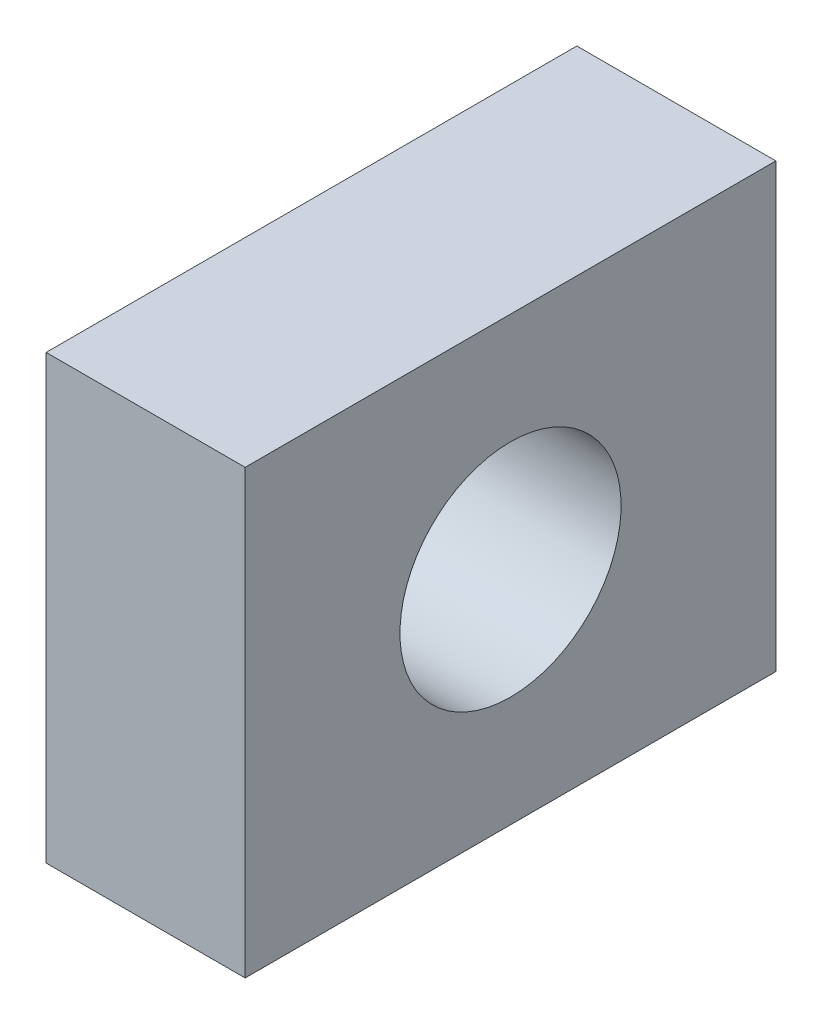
from build123d import *

# Parameters (mm, degrees)
ESQUISSE1_W             = 9
ESQUISSE1_H             = 20
BOSS_EXTRU_1_DEPTH      = 24
ESQUISSE2_R             = 5
ENL_V_MAT_EXTRU_1_DEPTH = 35.885715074


with BuildPart() as part:
    # Esquisse1 → Boss.-Extru.1 (new body)
    with BuildSketch(Plane.XY):
        with Locations((-17.749089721, 13.664596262)):
            Rectangle(ESQUISSE1_W, ESQUISSE1_H)
    extrude(amount=BOSS_EXTRU_1_DEPTH)

    # Esquisse2 → Enl_v. mat.-Extru.1 (cut, through all)
    with BuildSketch(Plane(origin=(-13.249089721, 0, 0), x_dir=(0, 0, -1), z_dir=(1, 0, 0))):
        with Locations(Location((-12, 13.664596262, 0), (0, 0, 90))):
            Circle(ESQUISSE2_R)
    extrude(amount=-ENL_V_MAT_EXTRU_1_DEPTH, mode=Mode.SUBTRACT)


solid = part.part
